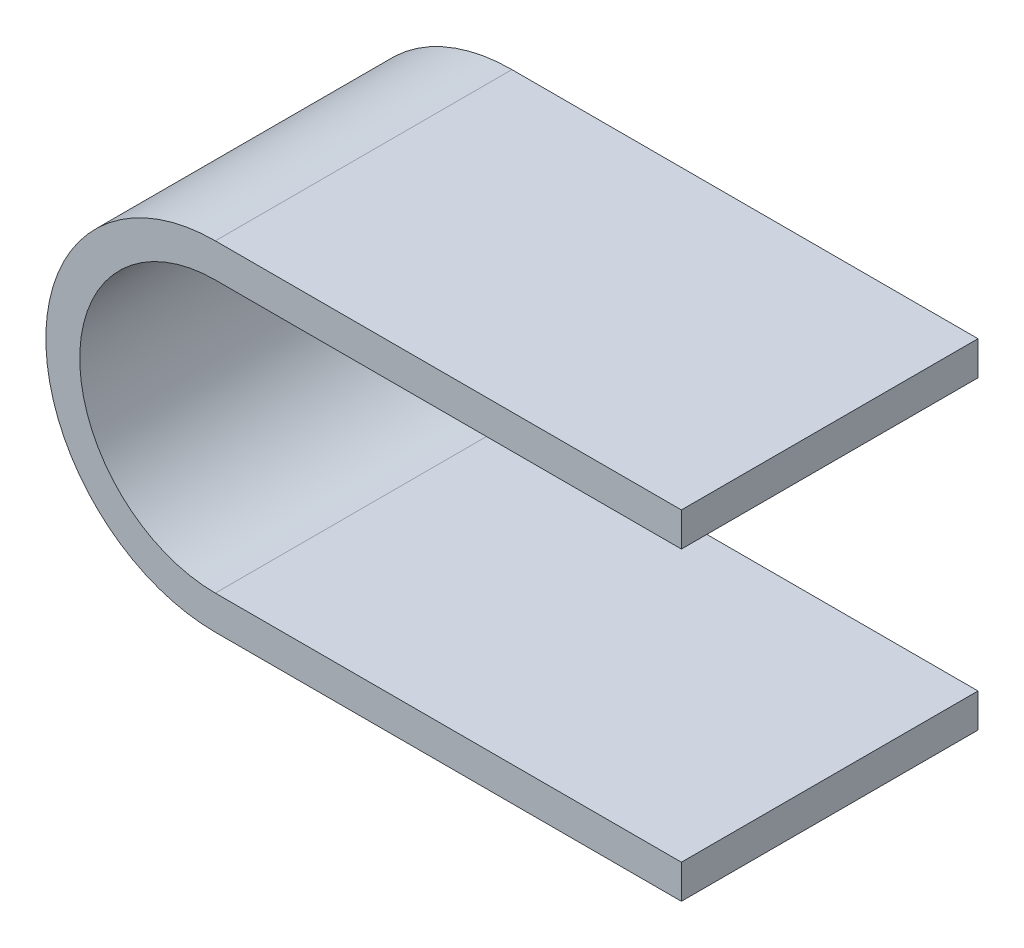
from build123d import *

# Parameters (mm, degrees)
BOSS_EXTRU_1_DEPTH = 35


with BuildPart() as part:
    # Esquisse1 → Boss.-Extru.1 (new body)
    with BuildSketch(Plane.XY):
        with BuildLine():
            Line((0, 0), (-55, 0))
            ThreePointArc((-55, 0), (-71, 16), (-55, 32))
            Line((-55, 32), (0, 32))
            Line((0, 32), (0, 36))
            Line((0, 36), (-55, 36))
            ThreePointArc((-55, 36), (-75, 16), (-55, -4))
            Line((-55, -4), (0, -4))
            Line((0, -4), (0, 0))
        make_face()
    extrude(amount=BOSS_EXTRU_1_DEPTH)


solid = part.part
